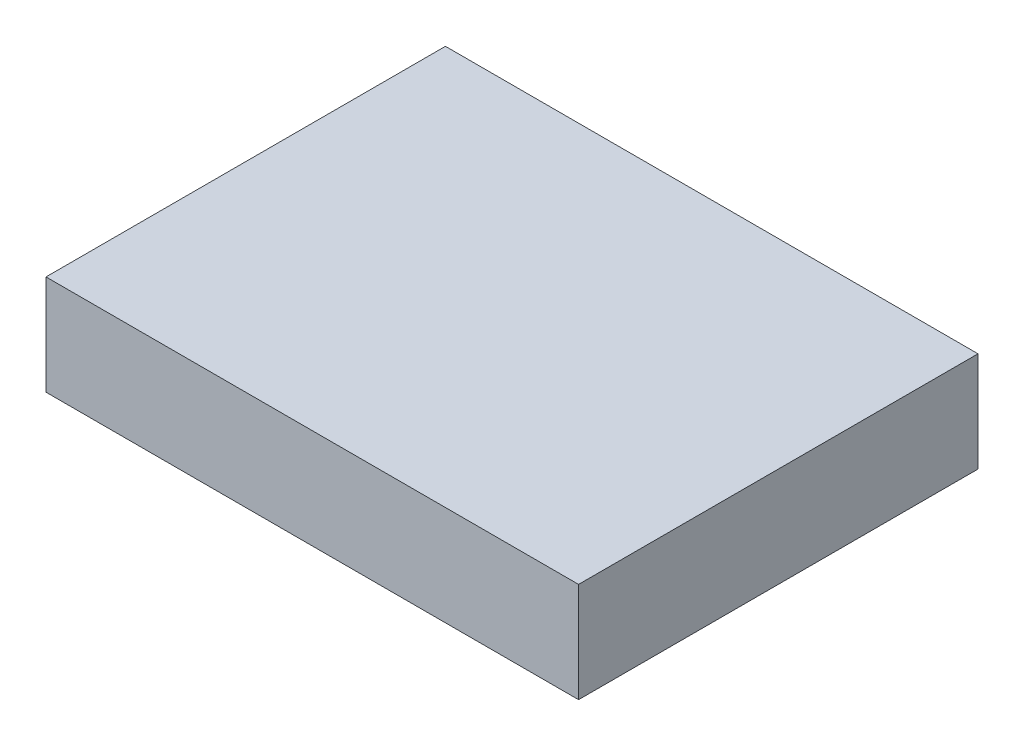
ISO-10303-21;
HEADER;
FILE_DESCRIPTION(('STEP AP214'),'2;1');
FILE_NAME('part.step','',(''),(''),'','','');
FILE_SCHEMA(('AUTOMOTIVE_DESIGN { 1 0 10303 214 1 1 1 1 }'));
ENDSEC;
DATA;
#1=APPLICATION_CONTEXT('core data for automotive mechanical design processes');
#2=APPLICATION_PROTOCOL_DEFINITION('international standard','automotive_design',2000,#1);
#3=PRODUCT_CONTEXT('',#1,'mechanical');
#4=PRODUCT('Part','Part','',(#3));
#5=PRODUCT_RELATED_PRODUCT_CATEGORY('part','',(#4));
#6=PRODUCT_DEFINITION_FORMATION('','',#4);
#7=PRODUCT_DEFINITION_CONTEXT('part definition',#1,'design');
#8=PRODUCT_DEFINITION('design','',#6,#7);
#9=PRODUCT_DEFINITION_SHAPE('','',#8);
#10=(LENGTH_UNIT() NAMED_UNIT(*) SI_UNIT(.MILLI.,.METRE.));
#11=(NAMED_UNIT(*) PLANE_ANGLE_UNIT() SI_UNIT($,.RADIAN.));
#12=(NAMED_UNIT(*) SI_UNIT($,.STERADIAN.) SOLID_ANGLE_UNIT());
#13=UNCERTAINTY_MEASURE_WITH_UNIT(LENGTH_MEASURE(1.E-05),#10,'distance_accuracy_value','');
#14=(GEOMETRIC_REPRESENTATION_CONTEXT(3) GLOBAL_UNCERTAINTY_ASSIGNED_CONTEXT((#13)) GLOBAL_UNIT_ASSIGNED_CONTEXT((#10,
#11,#12)) REPRESENTATION_CONTEXT('',''));
#15=CARTESIAN_POINT('',(0.,0.,0.));
#16=DIRECTION('',(0.,0.,1.));
#17=DIRECTION('',(1.,0.,0.));
#18=AXIS2_PLACEMENT_3D('',#15,#16,#17);
#19=CARTESIAN_POINT('',(0.,-15.,0.));
#20=DIRECTION('',(-1.,0.,0.));
#21=DIRECTION('',(0.,0.,1.));
#22=AXIS2_PLACEMENT_3D('',#19,#20,#21);
#23=PLANE('',#22);
#24=DIRECTION('',(0.,0.,1.));
#25=VECTOR('',#24,1.);
#26=CARTESIAN_POINT('',(0.,0.,0.));
#27=LINE('',#26,#25);
#28=CARTESIAN_POINT('',(0.,0.,-60.));
#29=VERTEX_POINT('',#28);
#30=CARTESIAN_POINT('',(0.,0.,0.));
#31=VERTEX_POINT('',#30);
#32=EDGE_CURVE('E103',#29,#31,#27,.T.);
#33=ORIENTED_EDGE('',*,*,#32,.F.);
#34=DIRECTION('',(0.,1.,0.));
#35=VECTOR('',#34,1.);
#36=CARTESIAN_POINT('',(0.,-15.,-60.));
#37=LINE('',#36,#35);
#38=CARTESIAN_POINT('',(0.,-15.,-60.));
#39=VERTEX_POINT('',#38);
#40=EDGE_CURVE('E11',#39,#29,#37,.T.);
#41=ORIENTED_EDGE('',*,*,#40,.F.);
#42=DIRECTION('',(0.,0.,1.));
#43=VECTOR('',#42,1.);
#44=CARTESIAN_POINT('',(0.,-15.,0.));
#45=LINE('',#44,#43);
#46=CARTESIAN_POINT('',(0.,-15.,0.));
#47=VERTEX_POINT('',#46);
#48=EDGE_CURVE('E100',#39,#47,#45,.T.);
#49=ORIENTED_EDGE('',*,*,#48,.T.);
#50=DIRECTION('',(0.,1.,0.));
#51=VECTOR('',#50,1.);
#52=CARTESIAN_POINT('',(0.,-15.,0.));
#53=LINE('',#52,#51);
#54=EDGE_CURVE('E45',#47,#31,#53,.T.);
#55=ORIENTED_EDGE('',*,*,#54,.T.);
#56=EDGE_LOOP('',(#33,#41,#49,#55));
#57=FACE_BOUND('',#56,.T.);
#58=ADVANCED_FACE('F39',(#57),#23,.T.);
#59=CARTESIAN_POINT('',(0.,-15.,-60.));
#60=DIRECTION('',(0.,0.,-1.));
#61=DIRECTION('',(-1.,0.,0.));
#62=AXIS2_PLACEMENT_3D('',#59,#60,#61);
#63=PLANE('',#62);
#64=DIRECTION('',(-1.,0.,0.));
#65=VECTOR('',#64,1.);
#66=CARTESIAN_POINT('',(0.,0.,-60.));
#67=LINE('',#66,#65);
#68=CARTESIAN_POINT('',(80.,0.,-60.));
#69=VERTEX_POINT('',#68);
#70=EDGE_CURVE('E97',#69,#29,#67,.T.);
#71=ORIENTED_EDGE('',*,*,#70,.F.);
#72=DIRECTION('',(0.,1.,0.));
#73=VECTOR('',#72,1.);
#74=CARTESIAN_POINT('',(80.,-15.,-60.));
#75=LINE('',#74,#73);
#76=CARTESIAN_POINT('',(80.,-15.,-60.));
#77=VERTEX_POINT('',#76);
#78=EDGE_CURVE('E48',#77,#69,#75,.T.);
#79=ORIENTED_EDGE('',*,*,#78,.F.);
#80=DIRECTION('',(-1.,0.,0.));
#81=VECTOR('',#80,1.);
#82=CARTESIAN_POINT('',(0.,-15.,-60.));
#83=LINE('',#82,#81);
#84=EDGE_CURVE('E94',#77,#39,#83,.T.);
#85=ORIENTED_EDGE('',*,*,#84,.T.);
#86=ORIENTED_EDGE('',*,*,#40,.T.);
#87=EDGE_LOOP('',(#71,#79,#85,#86));
#88=FACE_BOUND('',#87,.T.);
#89=ADVANCED_FACE('F114',(#88),#63,.T.);
#90=CARTESIAN_POINT('',(80.,-15.,0.));
#91=DIRECTION('',(1.,0.,0.));
#92=DIRECTION('',(0.,0.,-1.));
#93=AXIS2_PLACEMENT_3D('',#90,#91,#92);
#94=PLANE('',#93);
#95=DIRECTION('',(0.,0.,-1.));
#96=VECTOR('',#95,1.);
#97=CARTESIAN_POINT('',(80.,0.,0.));
#98=LINE('',#97,#96);
#99=CARTESIAN_POINT('',(80.,0.,0.));
#100=VERTEX_POINT('',#99);
#101=EDGE_CURVE('E90',#100,#69,#98,.T.);
#102=ORIENTED_EDGE('',*,*,#101,.F.);
#103=DIRECTION('',(0.,1.,0.));
#104=VECTOR('',#103,1.);
#105=CARTESIAN_POINT('',(80.,-15.,0.));
#106=LINE('',#105,#104);
#107=CARTESIAN_POINT('',(80.,-15.,0.));
#108=VERTEX_POINT('',#107);
#109=EDGE_CURVE('E81',#108,#100,#106,.T.);
#110=ORIENTED_EDGE('',*,*,#109,.F.);
#111=DIRECTION('',(0.,0.,-1.));
#112=VECTOR('',#111,1.);
#113=CARTESIAN_POINT('',(80.,-15.,0.));
#114=LINE('',#113,#112);
#115=EDGE_CURVE('E87',#108,#77,#114,.T.);
#116=ORIENTED_EDGE('',*,*,#115,.T.);
#117=ORIENTED_EDGE('',*,*,#78,.T.);
#118=EDGE_LOOP('',(#102,#110,#116,#117));
#119=FACE_BOUND('',#118,.T.);
#120=ADVANCED_FACE('F88',(#119),#94,.T.);
#121=CARTESIAN_POINT('',(0.,-15.,0.));
#122=DIRECTION('',(0.,0.,1.));
#123=DIRECTION('',(1.,0.,0.));
#124=AXIS2_PLACEMENT_3D('',#121,#122,#123);
#125=PLANE('',#124);
#126=DIRECTION('',(1.,0.,0.));
#127=VECTOR('',#126,1.);
#128=CARTESIAN_POINT('',(0.,0.,0.));
#129=LINE('',#128,#127);
#130=EDGE_CURVE('E106',#31,#100,#129,.T.);
#131=ORIENTED_EDGE('',*,*,#130,.F.);
#132=ORIENTED_EDGE('',*,*,#54,.F.);
#133=DIRECTION('',(1.,0.,0.));
#134=VECTOR('',#133,1.);
#135=CARTESIAN_POINT('',(0.,-15.,0.));
#136=LINE('',#135,#134);
#137=EDGE_CURVE('E91',#47,#108,#136,.T.);
#138=ORIENTED_EDGE('',*,*,#137,.T.);
#139=ORIENTED_EDGE('',*,*,#109,.T.);
#140=EDGE_LOOP('',(#131,#132,#138,#139));
#141=FACE_BOUND('',#140,.T.);
#142=ADVANCED_FACE('F96',(#141),#125,.T.);
#143=CARTESIAN_POINT('',(0.,-15.,0.));
#144=DIRECTION('',(0.,-1.,0.));
#145=DIRECTION('',(0.,0.,-1.));
#146=AXIS2_PLACEMENT_3D('',#143,#144,#145);
#147=PLANE('',#146);
#148=ORIENTED_EDGE('',*,*,#48,.F.);
#149=ORIENTED_EDGE('',*,*,#84,.F.);
#150=ORIENTED_EDGE('',*,*,#115,.F.);
#151=ORIENTED_EDGE('',*,*,#137,.F.);
#152=EDGE_LOOP('',(#148,#149,#150,#151));
#153=FACE_BOUND('',#152,.T.);
#154=ADVANCED_FACE('F95',(#153),#147,.T.);
#155=CARTESIAN_POINT('',(0.,0.,0.));
#156=DIRECTION('',(0.,-1.,0.));
#157=DIRECTION('',(0.,0.,-1.));
#158=AXIS2_PLACEMENT_3D('',#155,#156,#157);
#159=PLANE('',#158);
#160=ORIENTED_EDGE('',*,*,#32,.T.);
#161=ORIENTED_EDGE('',*,*,#130,.T.);
#162=ORIENTED_EDGE('',*,*,#101,.T.);
#163=ORIENTED_EDGE('',*,*,#70,.T.);
#164=EDGE_LOOP('',(#160,#161,#162,#163));
#165=FACE_BOUND('',#164,.T.);
#166=ADVANCED_FACE('F115',(#165),#159,.F.);
#167=CLOSED_SHELL('',(#58,#89,#120,#142,#154,#166));
#168=MANIFOLD_SOLID_BREP('B2',#167);
#169=ADVANCED_BREP_SHAPE_REPRESENTATION('',(#18,#168),#14);
#170=SHAPE_DEFINITION_REPRESENTATION(#9,#169);
ENDSEC;
END-ISO-10303-21;
